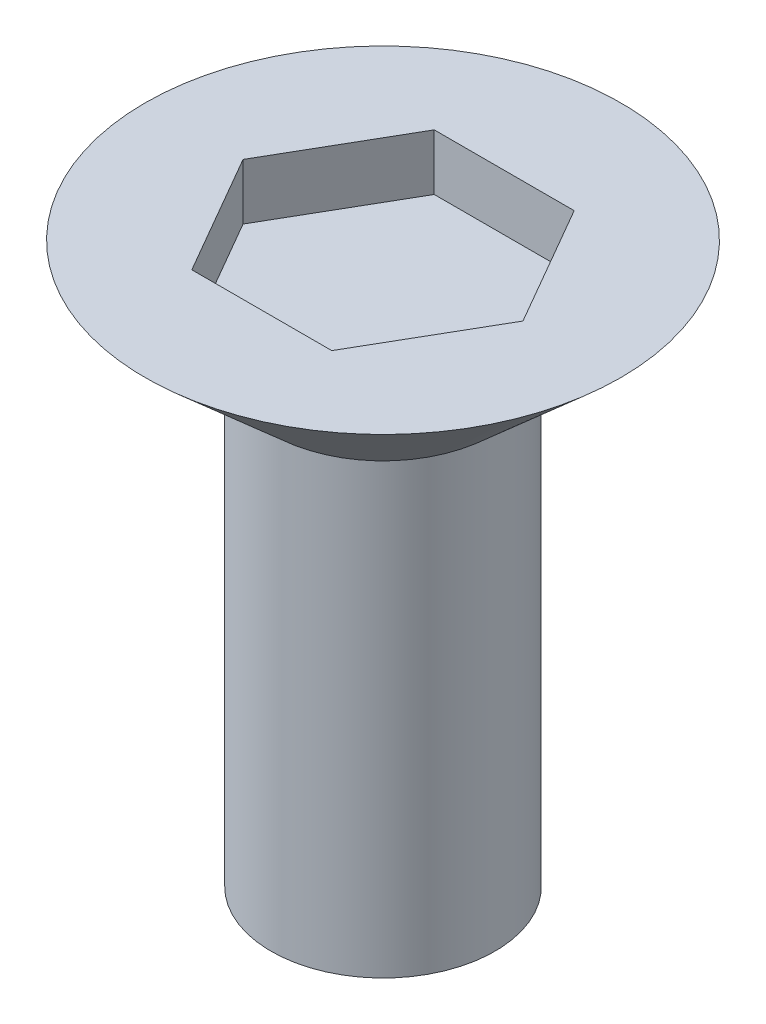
from build123d import *

# Parameters (mm, degrees)
CORTAR_EXTRUIR1_DEPTH = 2


with BuildPart() as part:
    # Croquis1 → Revoluci_n1 (revolve)
    with BuildSketch(Plane.XY):
        Polygon((-8.5, 20), (0, 20), (0, 0), (-4, 0), (-4, 16), align=None)
    revolve(axis=Axis((0, 20, 0), (0, -1, 0)))

    # Croquis2 → Cortar-Extruir1 (cut)
    with BuildSketch(Plane(origin=(0, 20, 0), x_dir=(1, 0, 0), z_dir=(0, 1, 0))):
        Polygon((-5, 0), (-2.5, 4.330127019), (2.5, 4.330127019), (5, 0), (2.5, -4.330127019), (-2.5, -4.330127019), align=None)
    extrude(amount=-CORTAR_EXTRUIR1_DEPTH, mode=Mode.SUBTRACT)


solid = part.part
